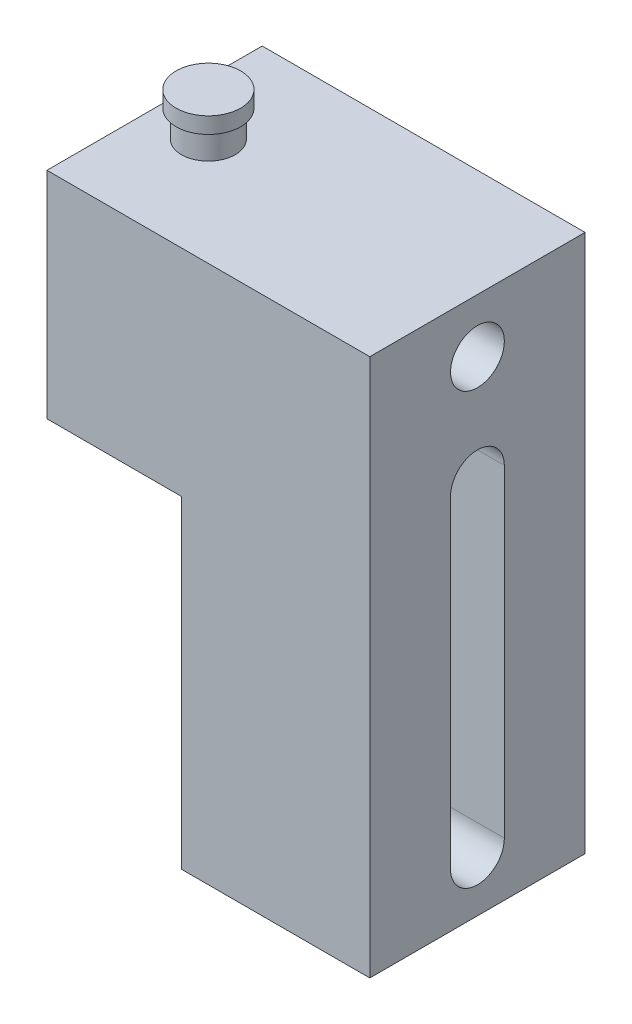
ISO-10303-21;
HEADER;
FILE_DESCRIPTION(('STEP AP214'),'2;1');
FILE_NAME('part.step','',(''),(''),'','','');
FILE_SCHEMA(('AUTOMOTIVE_DESIGN { 1 0 10303 214 1 1 1 1 }'));
ENDSEC;
DATA;
#1=APPLICATION_CONTEXT('core data for automotive mechanical design processes');
#2=APPLICATION_PROTOCOL_DEFINITION('international standard','automotive_design',2000,#1);
#3=PRODUCT_CONTEXT('',#1,'mechanical');
#4=PRODUCT('Part','Part','',(#3));
#5=PRODUCT_RELATED_PRODUCT_CATEGORY('part','',(#4));
#6=PRODUCT_DEFINITION_FORMATION('','',#4);
#7=PRODUCT_DEFINITION_CONTEXT('part definition',#1,'design');
#8=PRODUCT_DEFINITION('design','',#6,#7);
#9=PRODUCT_DEFINITION_SHAPE('','',#8);
#10=(LENGTH_UNIT() NAMED_UNIT(*) SI_UNIT(.MILLI.,.METRE.));
#11=(NAMED_UNIT(*) PLANE_ANGLE_UNIT() SI_UNIT($,.RADIAN.));
#12=(NAMED_UNIT(*) SI_UNIT($,.STERADIAN.) SOLID_ANGLE_UNIT());
#13=UNCERTAINTY_MEASURE_WITH_UNIT(LENGTH_MEASURE(1.E-05),#10,'distance_accuracy_value','');
#14=(GEOMETRIC_REPRESENTATION_CONTEXT(3) GLOBAL_UNCERTAINTY_ASSIGNED_CONTEXT((#13)) GLOBAL_UNIT_ASSIGNED_CONTEXT((#10,
#11,#12)) REPRESENTATION_CONTEXT('',''));
#15=CARTESIAN_POINT('',(0.,0.,0.));
#16=DIRECTION('',(0.,0.,1.));
#17=DIRECTION('',(1.,0.,0.));
#18=AXIS2_PLACEMENT_3D('',#15,#16,#17);
#19=CARTESIAN_POINT('',(0.,0.,40.));
#20=DIRECTION('',(0.,-1.,0.));
#21=DIRECTION('',(0.,0.,-1.));
#22=AXIS2_PLACEMENT_3D('',#19,#20,#21);
#23=PLANE('',#22);
#24=DIRECTION('',(-1.,0.,0.));
#25=VECTOR('',#24,1.);
#26=CARTESIAN_POINT('',(0.,0.,0.));
#27=LINE('',#26,#25);
#28=CARTESIAN_POINT('',(60.,0.,0.));
#29=VERTEX_POINT('',#28);
#30=CARTESIAN_POINT('',(0.,0.,0.));
#31=VERTEX_POINT('',#30);
#32=EDGE_CURVE('E162',#29,#31,#27,.T.);
#33=ORIENTED_EDGE('',*,*,#32,.T.);
#34=DIRECTION('',(0.,0.,-1.));
#35=VECTOR('',#34,1.);
#36=CARTESIAN_POINT('',(0.,0.,40.));
#37=LINE('',#36,#35);
#38=CARTESIAN_POINT('',(0.,0.,40.));
#39=VERTEX_POINT('',#38);
#40=EDGE_CURVE('E175',#39,#31,#37,.T.);
#41=ORIENTED_EDGE('',*,*,#40,.F.);
#42=DIRECTION('',(-1.,0.,0.));
#43=VECTOR('',#42,1.);
#44=CARTESIAN_POINT('',(0.,0.,40.));
#45=LINE('',#44,#43);
#46=CARTESIAN_POINT('',(60.,0.,40.));
#47=VERTEX_POINT('',#46);
#48=EDGE_CURVE('E47',#47,#39,#45,.T.);
#49=ORIENTED_EDGE('',*,*,#48,.F.);
#50=DIRECTION('',(0.,0.,-1.));
#51=VECTOR('',#50,1.);
#52=CARTESIAN_POINT('',(60.,0.,40.));
#53=LINE('',#52,#51);
#54=EDGE_CURVE('E178',#47,#29,#53,.T.);
#55=ORIENTED_EDGE('',*,*,#54,.T.);
#56=EDGE_LOOP('',(#33,#41,#49,#55));
#57=FACE_BOUND('',#56,.T.);
#58=CARTESIAN_POINT('',(9.99999999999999,0.,20.));
#59=DIRECTION('',(0.,-1.,0.));
#60=DIRECTION('',(0.,0.,-1.));
#61=AXIS2_PLACEMENT_3D('',#58,#59,#60);
#62=CIRCLE('',#61,5.);
#63=CARTESIAN_POINT('',(9.99999999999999,0.,15.));
#64=VERTEX_POINT('',#63);
#65=EDGE_CURVE('E11',#64,#64,#62,.F.);
#66=ORIENTED_EDGE('',*,*,#65,.F.);
#67=EDGE_LOOP('',(#66));
#68=FACE_BOUND('',#67,.T.);
#69=ADVANCED_FACE('F24',(#57,#68),#23,.F.);
#70=CARTESIAN_POINT('',(0.,-40.,40.));
#71=DIRECTION('',(1.,0.,0.));
#72=DIRECTION('',(0.,0.,-1.));
#73=AXIS2_PLACEMENT_3D('',#70,#71,#72);
#74=PLANE('',#73);
#75=DIRECTION('',(0.,-1.,0.));
#76=VECTOR('',#75,1.);
#77=CARTESIAN_POINT('',(0.,-40.,0.));
#78=LINE('',#77,#76);
#79=CARTESIAN_POINT('',(0.,-40.,0.));
#80=VERTEX_POINT('',#79);
#81=EDGE_CURVE('E151',#31,#80,#78,.T.);
#82=ORIENTED_EDGE('',*,*,#81,.T.);
#83=DIRECTION('',(0.,0.,-1.));
#84=VECTOR('',#83,1.);
#85=CARTESIAN_POINT('',(0.,-40.,40.));
#86=LINE('',#85,#84);
#87=CARTESIAN_POINT('',(0.,-40.,40.));
#88=VERTEX_POINT('',#87);
#89=EDGE_CURVE('E32',#88,#80,#86,.T.);
#90=ORIENTED_EDGE('',*,*,#89,.F.);
#91=DIRECTION('',(0.,-1.,0.));
#92=VECTOR('',#91,1.);
#93=CARTESIAN_POINT('',(0.,-40.,40.));
#94=LINE('',#93,#92);
#95=EDGE_CURVE('E164',#39,#88,#94,.T.);
#96=ORIENTED_EDGE('',*,*,#95,.F.);
#97=ORIENTED_EDGE('',*,*,#40,.T.);
#98=EDGE_LOOP('',(#82,#90,#96,#97));
#99=FACE_BOUND('',#98,.T.);
#100=ADVANCED_FACE('F26',(#99),#74,.F.);
#101=CARTESIAN_POINT('',(25.,-40.,40.));
#102=DIRECTION('',(0.,1.,0.));
#103=DIRECTION('',(-1.,0.,0.));
#104=AXIS2_PLACEMENT_3D('',#101,#102,#103);
#105=PLANE('',#104);
#106=DIRECTION('',(1.,0.,0.));
#107=VECTOR('',#106,1.);
#108=CARTESIAN_POINT('',(25.,-40.,0.));
#109=LINE('',#108,#107);
#110=CARTESIAN_POINT('',(25.,-40.,0.));
#111=VERTEX_POINT('',#110);
#112=EDGE_CURVE('E154',#80,#111,#109,.T.);
#113=ORIENTED_EDGE('',*,*,#112,.T.);
#114=DIRECTION('',(0.,0.,-1.));
#115=VECTOR('',#114,1.);
#116=CARTESIAN_POINT('',(25.,-40.,40.));
#117=LINE('',#116,#115);
#118=CARTESIAN_POINT('',(25.,-40.,40.));
#119=VERTEX_POINT('',#118);
#120=EDGE_CURVE('E187',#119,#111,#117,.T.);
#121=ORIENTED_EDGE('',*,*,#120,.F.);
#122=DIRECTION('',(1.,0.,0.));
#123=VECTOR('',#122,1.);
#124=CARTESIAN_POINT('',(25.,-40.,40.));
#125=LINE('',#124,#123);
#126=EDGE_CURVE('E166',#88,#119,#125,.T.);
#127=ORIENTED_EDGE('',*,*,#126,.F.);
#128=ORIENTED_EDGE('',*,*,#89,.T.);
#129=EDGE_LOOP('',(#113,#121,#127,#128));
#130=FACE_BOUND('',#129,.T.);
#131=ADVANCED_FACE('F192',(#130),#105,.F.);
#132=CARTESIAN_POINT('',(25.,-100.,40.));
#133=DIRECTION('',(1.,0.,0.));
#134=DIRECTION('',(0.,0.,-1.));
#135=AXIS2_PLACEMENT_3D('',#132,#133,#134);
#136=PLANE('',#135);
#137=DIRECTION('',(0.,-1.,0.));
#138=VECTOR('',#137,1.);
#139=CARTESIAN_POINT('',(25.,-100.,0.));
#140=LINE('',#139,#138);
#141=CARTESIAN_POINT('',(25.,-100.,0.));
#142=VERTEX_POINT('',#141);
#143=EDGE_CURVE('E156',#111,#142,#140,.T.);
#144=ORIENTED_EDGE('',*,*,#143,.T.);
#145=DIRECTION('',(0.,0.,-1.));
#146=VECTOR('',#145,1.);
#147=CARTESIAN_POINT('',(25.,-100.,40.));
#148=LINE('',#147,#146);
#149=CARTESIAN_POINT('',(25.,-100.,40.));
#150=VERTEX_POINT('',#149);
#151=EDGE_CURVE('E184',#150,#142,#148,.T.);
#152=ORIENTED_EDGE('',*,*,#151,.F.);
#153=DIRECTION('',(0.,-1.,0.));
#154=VECTOR('',#153,1.);
#155=CARTESIAN_POINT('',(25.,-100.,40.));
#156=LINE('',#155,#154);
#157=EDGE_CURVE('E168',#119,#150,#156,.T.);
#158=ORIENTED_EDGE('',*,*,#157,.F.);
#159=ORIENTED_EDGE('',*,*,#120,.T.);
#160=EDGE_LOOP('',(#144,#152,#158,#159));
#161=FACE_BOUND('',#160,.T.);
#162=ADVANCED_FACE('F205',(#161),#136,.F.);
#163=CARTESIAN_POINT('',(60.,-100.,40.));
#164=DIRECTION('',(0.,1.,0.));
#165=DIRECTION('',(0.,0.,1.));
#166=AXIS2_PLACEMENT_3D('',#163,#164,#165);
#167=PLANE('',#166);
#168=DIRECTION('',(1.,0.,0.));
#169=VECTOR('',#168,1.);
#170=CARTESIAN_POINT('',(60.,-100.,0.));
#171=LINE('',#170,#169);
#172=CARTESIAN_POINT('',(60.,-100.,0.));
#173=VERTEX_POINT('',#172);
#174=EDGE_CURVE('E158',#142,#173,#171,.T.);
#175=ORIENTED_EDGE('',*,*,#174,.T.);
#176=DIRECTION('',(0.,0.,-1.));
#177=VECTOR('',#176,1.);
#178=CARTESIAN_POINT('',(60.,-100.,40.));
#179=LINE('',#178,#177);
#180=CARTESIAN_POINT('',(60.,-100.,40.));
#181=VERTEX_POINT('',#180);
#182=EDGE_CURVE('E181',#181,#173,#179,.T.);
#183=ORIENTED_EDGE('',*,*,#182,.F.);
#184=DIRECTION('',(1.,0.,0.));
#185=VECTOR('',#184,1.);
#186=CARTESIAN_POINT('',(60.,-100.,40.));
#187=LINE('',#186,#185);
#188=EDGE_CURVE('E170',#150,#181,#187,.T.);
#189=ORIENTED_EDGE('',*,*,#188,.F.);
#190=ORIENTED_EDGE('',*,*,#151,.T.);
#191=EDGE_LOOP('',(#175,#183,#189,#190));
#192=FACE_BOUND('',#191,.T.);
#193=ADVANCED_FACE('F209',(#192),#167,.F.);
#194=CARTESIAN_POINT('',(60.,0.,40.));
#195=DIRECTION('',(-1.,0.,0.));
#196=DIRECTION('',(0.,-1.,0.));
#197=AXIS2_PLACEMENT_3D('',#194,#195,#196);
#198=PLANE('',#197);
#199=DIRECTION('',(0.,1.,0.));
#200=VECTOR('',#199,1.);
#201=CARTESIAN_POINT('',(60.,-90.,15.));
#202=LINE('',#201,#200);
#203=CARTESIAN_POINT('',(60.,-90.,15.));
#204=VERTEX_POINT('',#203);
#205=CARTESIAN_POINT('',(60.,-30.,15.));
#206=VERTEX_POINT('',#205);
#207=EDGE_CURVE('E117',#204,#206,#202,.T.);
#208=ORIENTED_EDGE('',*,*,#207,.F.);
#209=CARTESIAN_POINT('',(60.,-90.,20.));
#210=DIRECTION('',(1.,0.,0.));
#211=DIRECTION('',(0.,1.,0.));
#212=AXIS2_PLACEMENT_3D('',#209,#210,#211);
#213=CIRCLE('',#212,5.);
#214=CARTESIAN_POINT('',(60.,-90.,25.));
#215=VERTEX_POINT('',#214);
#216=EDGE_CURVE('E39',#215,#204,#213,.T.);
#217=ORIENTED_EDGE('',*,*,#216,.F.);
#218=DIRECTION('',(0.,-1.,0.));
#219=VECTOR('',#218,1.);
#220=CARTESIAN_POINT('',(60.,-90.,25.));
#221=LINE('',#220,#219);
#222=CARTESIAN_POINT('',(60.,-30.,25.));
#223=VERTEX_POINT('',#222);
#224=EDGE_CURVE('E124',#223,#215,#221,.T.);
#225=ORIENTED_EDGE('',*,*,#224,.F.);
#226=CARTESIAN_POINT('',(60.,-30.,20.));
#227=DIRECTION('',(1.,0.,0.));
#228=DIRECTION('',(0.,-1.,0.));
#229=AXIS2_PLACEMENT_3D('',#226,#227,#228);
#230=CIRCLE('',#229,5.);
#231=EDGE_CURVE('E106',#206,#223,#230,.T.);
#232=ORIENTED_EDGE('',*,*,#231,.F.);
#233=EDGE_LOOP('',(#208,#217,#225,#232));
#234=FACE_BOUND('',#233,.T.);
#235=CARTESIAN_POINT('',(60.,-10.,20.));
#236=DIRECTION('',(1.,0.,0.));
#237=DIRECTION('',(0.,1.,0.));
#238=AXIS2_PLACEMENT_3D('',#235,#236,#237);
#239=CIRCLE('',#238,5.);
#240=CARTESIAN_POINT('',(60.,-5.,20.));
#241=VERTEX_POINT('',#240);
#242=EDGE_CURVE('E140',#241,#241,#239,.T.);
#243=ORIENTED_EDGE('',*,*,#242,.F.);
#244=EDGE_LOOP('',(#243));
#245=FACE_BOUND('',#244,.T.);
#246=DIRECTION('',(0.,1.,0.));
#247=VECTOR('',#246,1.);
#248=CARTESIAN_POINT('',(60.,0.,0.));
#249=LINE('',#248,#247);
#250=EDGE_CURVE('E160',#173,#29,#249,.T.);
#251=ORIENTED_EDGE('',*,*,#250,.T.);
#252=ORIENTED_EDGE('',*,*,#54,.F.);
#253=DIRECTION('',(0.,1.,0.));
#254=VECTOR('',#253,1.);
#255=CARTESIAN_POINT('',(60.,0.,40.));
#256=LINE('',#255,#254);
#257=EDGE_CURVE('E172',#181,#47,#256,.T.);
#258=ORIENTED_EDGE('',*,*,#257,.F.);
#259=ORIENTED_EDGE('',*,*,#182,.T.);
#260=EDGE_LOOP('',(#251,#252,#258,#259));
#261=FACE_BOUND('',#260,.T.);
#262=ADVANCED_FACE('F121',(#234,#245,#261),#198,.F.);
#263=CARTESIAN_POINT('',(0.,0.,40.));
#264=DIRECTION('',(0.,0.,-1.));
#265=DIRECTION('',(-1.,0.,0.));
#266=AXIS2_PLACEMENT_3D('',#263,#264,#265);
#267=PLANE('',#266);
#268=ORIENTED_EDGE('',*,*,#95,.T.);
#269=ORIENTED_EDGE('',*,*,#126,.T.);
#270=ORIENTED_EDGE('',*,*,#157,.T.);
#271=ORIENTED_EDGE('',*,*,#188,.T.);
#272=ORIENTED_EDGE('',*,*,#257,.T.);
#273=ORIENTED_EDGE('',*,*,#48,.T.);
#274=EDGE_LOOP('',(#268,#269,#270,#271,#272,#273));
#275=FACE_BOUND('',#274,.T.);
#276=ADVANCED_FACE('F212',(#275),#267,.F.);
#277=CARTESIAN_POINT('',(0.,0.,0.));
#278=DIRECTION('',(0.,0.,-1.));
#279=DIRECTION('',(-1.,0.,0.));
#280=AXIS2_PLACEMENT_3D('',#277,#278,#279);
#281=PLANE('',#280);
#282=ORIENTED_EDGE('',*,*,#81,.F.);
#283=ORIENTED_EDGE('',*,*,#32,.F.);
#284=ORIENTED_EDGE('',*,*,#250,.F.);
#285=ORIENTED_EDGE('',*,*,#174,.F.);
#286=ORIENTED_EDGE('',*,*,#143,.F.);
#287=ORIENTED_EDGE('',*,*,#112,.F.);
#288=EDGE_LOOP('',(#282,#283,#284,#285,#286,#287));
#289=FACE_BOUND('',#288,.T.);
#290=ADVANCED_FACE('F199',(#289),#281,.T.);
#291=CARTESIAN_POINT('',(9.99999999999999,5.,20.));
#292=DIRECTION('',(0.,-1.,0.));
#293=DIRECTION('',(0.,0.,-1.));
#294=AXIS2_PLACEMENT_3D('',#291,#292,#293);
#295=CYLINDRICAL_SURFACE('',#294,5.);
#296=CARTESIAN_POINT('',(9.99999999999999,5.,20.));
#297=DIRECTION('',(0.,1.,0.));
#298=DIRECTION('',(0.,0.,1.));
#299=AXIS2_PLACEMENT_3D('',#296,#297,#298);
#300=CIRCLE('',#299,5.);
#301=CARTESIAN_POINT('',(9.99999999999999,5.,25.));
#302=VERTEX_POINT('',#301);
#303=EDGE_CURVE('E148',#302,#302,#300,.T.);
#304=ORIENTED_EDGE('',*,*,#303,.F.);
#305=EDGE_LOOP('',(#304));
#306=FACE_BOUND('',#305,.T.);
#307=ORIENTED_EDGE('',*,*,#65,.T.);
#308=EDGE_LOOP('',(#307));
#309=FACE_BOUND('',#308,.T.);
#310=ADVANCED_FACE('F221',(#306,#309),#295,.T.);
#311=CARTESIAN_POINT('',(50.,-10.,20.));
#312=DIRECTION('',(1.,0.,0.));
#313=DIRECTION('',(0.,1.,0.));
#314=AXIS2_PLACEMENT_3D('',#311,#312,#313);
#315=CYLINDRICAL_SURFACE('',#314,5.);
#316=CARTESIAN_POINT('',(50.,-10.,20.));
#317=DIRECTION('',(1.,0.,0.));
#318=DIRECTION('',(0.,1.,0.));
#319=AXIS2_PLACEMENT_3D('',#316,#317,#318);
#320=CIRCLE('',#319,5.);
#321=CARTESIAN_POINT('',(50.,-5.,20.));
#322=VERTEX_POINT('',#321);
#323=EDGE_CURVE('E145',#322,#322,#320,.T.);
#324=ORIENTED_EDGE('',*,*,#323,.F.);
#325=EDGE_LOOP('',(#324));
#326=FACE_BOUND('',#325,.T.);
#327=ORIENTED_EDGE('',*,*,#242,.T.);
#328=EDGE_LOOP('',(#327));
#329=FACE_BOUND('',#328,.T.);
#330=ADVANCED_FACE('F223',(#326,#329),#315,.F.);
#331=CARTESIAN_POINT('',(50.,-10.,20.));
#332=DIRECTION('',(1.,0.,0.));
#333=DIRECTION('',(0.,1.,0.));
#334=AXIS2_PLACEMENT_3D('',#331,#332,#333);
#335=PLANE('',#334);
#336=ORIENTED_EDGE('',*,*,#323,.T.);
#337=EDGE_LOOP('',(#336));
#338=FACE_BOUND('',#337,.T.);
#339=ADVANCED_FACE('F230',(#338),#335,.T.);
#340=CARTESIAN_POINT('',(40.,-90.,20.));
#341=DIRECTION('',(1.,0.,0.));
#342=DIRECTION('',(0.,1.,0.));
#343=AXIS2_PLACEMENT_3D('',#340,#341,#342);
#344=CYLINDRICAL_SURFACE('',#343,5.);
#345=ORIENTED_EDGE('',*,*,#216,.T.);
#346=DIRECTION('',(1.,0.,0.));
#347=VECTOR('',#346,1.);
#348=CARTESIAN_POINT('',(40.,-90.,15.));
#349=LINE('',#348,#347);
#350=CARTESIAN_POINT('',(40.,-90.,15.));
#351=VERTEX_POINT('',#350);
#352=EDGE_CURVE('E114',#351,#204,#349,.T.);
#353=ORIENTED_EDGE('',*,*,#352,.F.);
#354=CARTESIAN_POINT('',(40.,-90.,20.));
#355=DIRECTION('',(1.,0.,0.));
#356=DIRECTION('',(0.,1.,0.));
#357=AXIS2_PLACEMENT_3D('',#354,#355,#356);
#358=CIRCLE('',#357,5.);
#359=CARTESIAN_POINT('',(40.,-90.,25.));
#360=VERTEX_POINT('',#359);
#361=EDGE_CURVE('E126',#360,#351,#358,.T.);
#362=ORIENTED_EDGE('',*,*,#361,.F.);
#363=DIRECTION('',(1.,0.,0.));
#364=VECTOR('',#363,1.);
#365=CARTESIAN_POINT('',(40.,-90.,25.));
#366=LINE('',#365,#364);
#367=EDGE_CURVE('E138',#360,#215,#366,.T.);
#368=ORIENTED_EDGE('',*,*,#367,.T.);
#369=EDGE_LOOP('',(#345,#353,#362,#368));
#370=FACE_BOUND('',#369,.T.);
#371=ADVANCED_FACE('F271',(#370),#344,.F.);
#372=CARTESIAN_POINT('',(40.,-90.,25.));
#373=DIRECTION('',(0.,0.,1.));
#374=DIRECTION('',(0.,-1.,0.));
#375=AXIS2_PLACEMENT_3D('',#372,#373,#374);
#376=PLANE('',#375);
#377=ORIENTED_EDGE('',*,*,#224,.T.);
#378=ORIENTED_EDGE('',*,*,#367,.F.);
#379=DIRECTION('',(0.,-1.,0.));
#380=VECTOR('',#379,1.);
#381=CARTESIAN_POINT('',(40.,-90.,25.));
#382=LINE('',#381,#380);
#383=CARTESIAN_POINT('',(40.,-30.,25.));
#384=VERTEX_POINT('',#383);
#385=EDGE_CURVE('E135',#384,#360,#382,.T.);
#386=ORIENTED_EDGE('',*,*,#385,.F.);
#387=DIRECTION('',(1.,0.,0.));
#388=VECTOR('',#387,1.);
#389=CARTESIAN_POINT('',(40.,-30.,25.));
#390=LINE('',#389,#388);
#391=EDGE_CURVE('E113',#384,#223,#390,.T.);
#392=ORIENTED_EDGE('',*,*,#391,.T.);
#393=EDGE_LOOP('',(#377,#378,#386,#392));
#394=FACE_BOUND('',#393,.T.);
#395=ADVANCED_FACE('F278',(#394),#376,.F.);
#396=CARTESIAN_POINT('',(40.,-30.,20.));
#397=DIRECTION('',(1.,0.,0.));
#398=DIRECTION('',(0.,1.,0.));
#399=AXIS2_PLACEMENT_3D('',#396,#397,#398);
#400=CYLINDRICAL_SURFACE('',#399,5.);
#401=ORIENTED_EDGE('',*,*,#231,.T.);
#402=ORIENTED_EDGE('',*,*,#391,.F.);
#403=CARTESIAN_POINT('',(40.,-30.,20.));
#404=DIRECTION('',(1.,0.,0.));
#405=DIRECTION('',(0.,-1.,0.));
#406=AXIS2_PLACEMENT_3D('',#403,#404,#405);
#407=CIRCLE('',#406,5.);
#408=CARTESIAN_POINT('',(40.,-30.,15.));
#409=VERTEX_POINT('',#408);
#410=EDGE_CURVE('E109',#409,#384,#407,.T.);
#411=ORIENTED_EDGE('',*,*,#410,.F.);
#412=DIRECTION('',(1.,0.,0.));
#413=VECTOR('',#412,1.);
#414=CARTESIAN_POINT('',(40.,-30.,15.));
#415=LINE('',#414,#413);
#416=EDGE_CURVE('E102',#409,#206,#415,.T.);
#417=ORIENTED_EDGE('',*,*,#416,.T.);
#418=EDGE_LOOP('',(#401,#402,#411,#417));
#419=FACE_BOUND('',#418,.T.);
#420=ADVANCED_FACE('F104',(#419),#400,.F.);
#421=CARTESIAN_POINT('',(40.,-90.,15.));
#422=DIRECTION('',(0.,0.,-1.));
#423=DIRECTION('',(0.,1.,0.));
#424=AXIS2_PLACEMENT_3D('',#421,#422,#423);
#425=PLANE('',#424);
#426=ORIENTED_EDGE('',*,*,#207,.T.);
#427=ORIENTED_EDGE('',*,*,#416,.F.);
#428=DIRECTION('',(0.,1.,0.));
#429=VECTOR('',#428,1.);
#430=CARTESIAN_POINT('',(40.,-90.,15.));
#431=LINE('',#430,#429);
#432=EDGE_CURVE('E132',#351,#409,#431,.T.);
#433=ORIENTED_EDGE('',*,*,#432,.F.);
#434=ORIENTED_EDGE('',*,*,#352,.T.);
#435=EDGE_LOOP('',(#426,#427,#433,#434));
#436=FACE_BOUND('',#435,.T.);
#437=ADVANCED_FACE('F118',(#436),#425,.F.);
#438=CARTESIAN_POINT('',(40.,-90.,20.));
#439=DIRECTION('',(1.,0.,0.));
#440=DIRECTION('',(0.,1.,0.));
#441=AXIS2_PLACEMENT_3D('',#438,#439,#440);
#442=PLANE('',#441);
#443=ORIENTED_EDGE('',*,*,#361,.T.);
#444=ORIENTED_EDGE('',*,*,#432,.T.);
#445=ORIENTED_EDGE('',*,*,#410,.T.);
#446=ORIENTED_EDGE('',*,*,#385,.T.);
#447=EDGE_LOOP('',(#443,#444,#445,#446));
#448=FACE_BOUND('',#447,.T.);
#449=ADVANCED_FACE('F298',(#448),#442,.T.);
#450=CARTESIAN_POINT('',(9.99999999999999,5.,20.));
#451=DIRECTION('',(0.,1.,0.));
#452=DIRECTION('',(0.,0.,1.));
#453=AXIS2_PLACEMENT_3D('',#450,#451,#452);
#454=PLANE('',#453);
#455=CARTESIAN_POINT('',(9.99999999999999,5.,20.));
#456=DIRECTION('',(0.,1.,0.));
#457=DIRECTION('',(0.,0.,1.));
#458=AXIS2_PLACEMENT_3D('',#455,#456,#457);
#459=CIRCLE('',#458,6.);
#460=CARTESIAN_POINT('',(9.99999999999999,5.,26.));
#461=VERTEX_POINT('',#460);
#462=EDGE_CURVE('E334',#461,#461,#459,.T.);
#463=ORIENTED_EDGE('',*,*,#462,.F.);
#464=EDGE_LOOP('',(#463));
#465=FACE_BOUND('',#464,.T.);
#466=ORIENTED_EDGE('',*,*,#303,.T.);
#467=EDGE_LOOP('',(#466));
#468=FACE_BOUND('',#467,.T.);
#469=ADVANCED_FACE('F305',(#465,#468),#454,.F.);
#470=CARTESIAN_POINT('',(9.99999999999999,8.,20.));
#471=DIRECTION('',(0.,-1.,0.));
#472=DIRECTION('',(0.,0.,-1.));
#473=AXIS2_PLACEMENT_3D('',#470,#471,#472);
#474=CYLINDRICAL_SURFACE('',#473,6.);
#475=CARTESIAN_POINT('',(9.99999999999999,8.,20.));
#476=DIRECTION('',(0.,1.,0.));
#477=DIRECTION('',(0.,0.,1.));
#478=AXIS2_PLACEMENT_3D('',#475,#476,#477);
#479=CIRCLE('',#478,6.);
#480=CARTESIAN_POINT('',(9.99999999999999,8.,26.));
#481=VERTEX_POINT('',#480);
#482=EDGE_CURVE('E333',#481,#481,#479,.T.);
#483=ORIENTED_EDGE('',*,*,#482,.F.);
#484=EDGE_LOOP('',(#483));
#485=FACE_BOUND('',#484,.T.);
#486=ORIENTED_EDGE('',*,*,#462,.T.);
#487=EDGE_LOOP('',(#486));
#488=FACE_BOUND('',#487,.T.);
#489=ADVANCED_FACE('F313',(#485,#488),#474,.T.);
#490=CARTESIAN_POINT('',(9.99999999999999,8.,20.));
#491=DIRECTION('',(0.,1.,0.));
#492=DIRECTION('',(0.,0.,1.));
#493=AXIS2_PLACEMENT_3D('',#490,#491,#492);
#494=PLANE('',#493);
#495=ORIENTED_EDGE('',*,*,#482,.T.);
#496=EDGE_LOOP('',(#495));
#497=FACE_BOUND('',#496,.T.);
#498=ADVANCED_FACE('F321',(#497),#494,.T.);
#499=CLOSED_SHELL('',(#69,#100,#131,#162,#193,#262,#276,#290,#310,#330,#339,#371,#395,#420,#437,
#449,#469,#489,#498));
#500=MANIFOLD_SOLID_BREP('B2',#499);
#501=ADVANCED_BREP_SHAPE_REPRESENTATION('',(#18,#500),#14);
#502=SHAPE_DEFINITION_REPRESENTATION(#9,#501);
ENDSEC;
END-ISO-10303-21;
